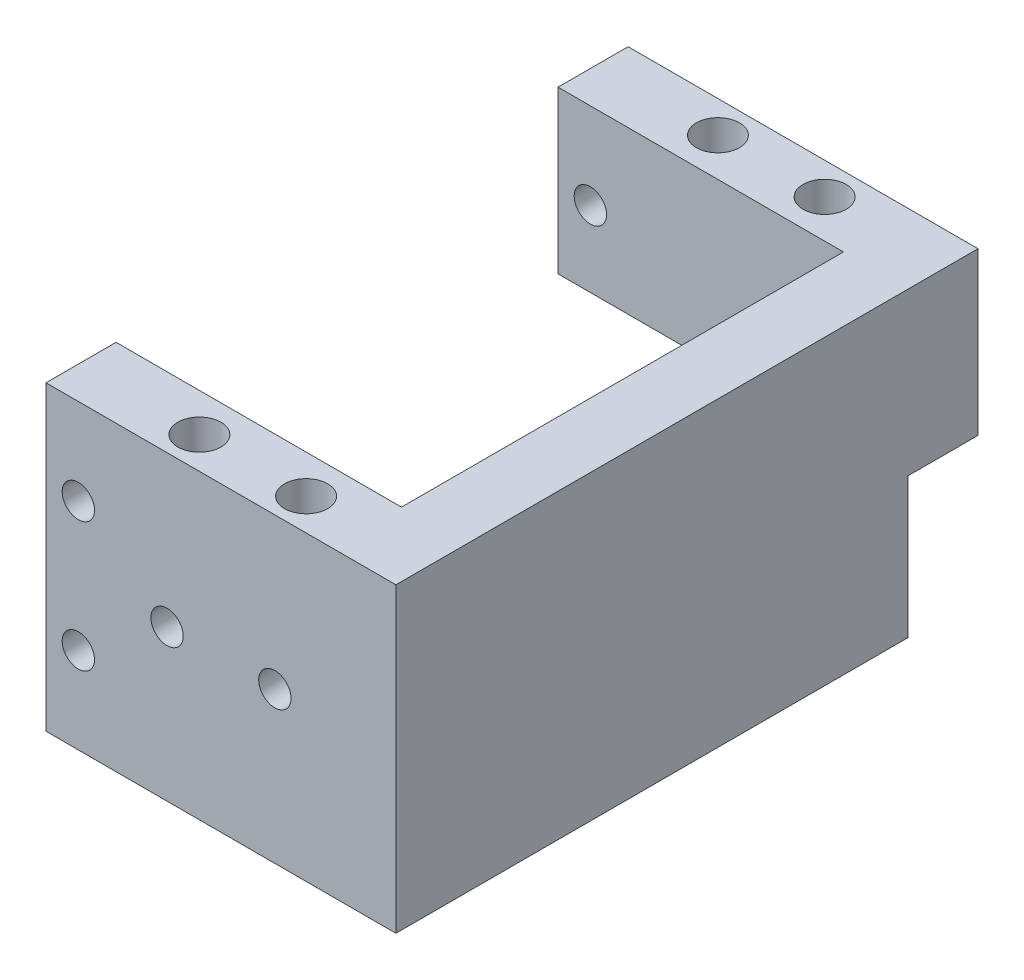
from build123d import *

# Parameters (mm, degrees)
SKETCH2_W           = 5.98
SKETCH2_H           = 20.5
SKETCH2_R           = 1.5
SKETCH2_R_2         = 2
BOSS_EXTRUDE1_DEPTH = 28
SKETCH2_4_R         = 1.5
CUT_EXTRUDE1_DEPTH  = 15
SKETCH3_W           = 6.5
SKETCH3_H           = 15
BOSS_EXTRUDE2_DEPTH = 32.46
SKETCH2_5_R         = 2
CUT_EXTRUDE2_DEPTH  = 94.46
SKETCH2_6_R         = 2
CUT_EXTRUDE4_DEPTH  = 8
CUT_EXTRUDE5_START  = -8
SKETCH5_R           = 2
CUT_EXTRUDE5_DEPTH  = 8
CUT_EXTRUDE3_DEPTH  = 10
CUT_EXTRUDE6_DEPTH  = 3.5
CUT_EXTRUDE7_REACH  = 54.466
SKETCH11_W          = 41
SKETCH11_H          = 28
SKETCH12_R          = 1.5
CUT_EXTRUDE8_DEPTH  = 64


with BuildPart() as part:
    # Sketch2 → Boss-Extrude1 (new body)
    # profile 1 of 12: a face of its own
    with BuildSketch(Plane(origin=(0, 0, 0), x_dir=(1, 0, 0), z_dir=(0, 1, 0))):
        with Locations((-13.24, -7)):
            Rectangle(SKETCH2_W, SKETCH2_H)
        with Locations((-13.23, -13.25)):
            Circle(SKETCH2_R, mode=Mode.SUBTRACT)
    # profile 2 of 12: a face of its own
    with BuildSketch(Plane(origin=(0, 0, 0), x_dir=(1, 0, 0), z_dir=(0, 1, 0))):
        with Locations((-13.23, -13.25)):
            Circle(SKETCH2_R)
    # profile 3 of 12: a face of its own
    with BuildSketch(Plane(origin=(0, 0, 0), x_dir=(1, 0, 0), z_dir=(0, 1, 0))):
        with Locations((-13.24, 13.5)):
            Rectangle(SKETCH2_W, SKETCH2_H)
        with Locations((-13.23, 19.75)):
            Circle(SKETCH2_R, mode=Mode.SUBTRACT)
    # profile 4 of 12: a face of its own
    with BuildSketch(Plane(origin=(0, 0, 0), x_dir=(1, 0, 0), z_dir=(0, 1, 0))):
        with Locations((-13.23, 19.75)):
            Circle(SKETCH2_R)
    # profile 5 of 12: a face of its own
    with BuildSketch(Plane(origin=(0, 0, 0), x_dir=(1, 0, 0), z_dir=(0, 1, 0))):
        with Locations((13.24, 13.5)):
            Rectangle(SKETCH2_W, SKETCH2_H)
        with Locations((13.23, 19.75)):
            Circle(SKETCH2_R, mode=Mode.SUBTRACT)
    # profile 6 of 12: a face of its own
    with BuildSketch(Plane(origin=(0, 0, 0), x_dir=(1, 0, 0), z_dir=(0, 1, 0))):
        with Locations((13.23, 19.75)):
            Circle(SKETCH2_R)
    # profile 7 of 12: a face of its own
    with BuildSketch(Plane(origin=(0, 0, 0), x_dir=(1, 0, 0), z_dir=(0, 1, 0))):
        with Locations((13.24, -7)):
            Rectangle(SKETCH2_W, SKETCH2_H)
        with Locations((13.23, -13.25)):
            Circle(SKETCH2_R, mode=Mode.SUBTRACT)
    # profile 8 of 12: a face of its own
    with BuildSketch(Plane(origin=(0, 0, 0), x_dir=(1, 0, 0), z_dir=(0, 1, 0))):
        with Locations((13.23, -13.25)):
            Circle(SKETCH2_R)
    # profile 9 of 12: a face of its own
    with BuildSketch(Plane(origin=(0, 0, 0), x_dir=(1, 0, 0), z_dir=(0, 1, 0))):
        Polygon((0, -23.75), (0, -17.25), (-10.25, -17.25), (-16.23, -17.25), (-16.23, -23.75), align=None)
        with Locations((-4.95, -20.8)):
            Circle(SKETCH2_R_2, mode=Mode.SUBTRACT)
    # profile 10 of 12: a face of its own
    with BuildSketch(Plane(origin=(0, 0, 0), x_dir=(1, 0, 0), z_dir=(0, 1, 0))):
        with Locations((-4.95, -20.8)):
            Circle(SKETCH2_R_2)
    # profile 11 of 12: a face of its own
    with BuildSketch(Plane(origin=(0, 0, 0), x_dir=(1, 0, 0), z_dir=(0, 1, 0))):
        Polygon((10.25, -17.25), (0, -17.25), (0, -23.75), (16.23, -23.75), (16.23, -17.25), align=None)
        with Locations((4.95, -20.8)):
            Circle(SKETCH2_R_2, mode=Mode.SUBTRACT)
    # profile 12 of 12: a face of its own
    with BuildSketch(Plane(origin=(0, 0, 0), x_dir=(1, 0, 0), z_dir=(0, 1, 0))):
        with Locations((4.95, -20.8)):
            Circle(SKETCH2_R_2)
    extrude(amount=BOSS_EXTRUDE1_DEPTH)

    # Sketch2_4 → Cut-Extrude1 (cut)
    with BuildSketch(Plane(origin=(0, 0, 0), x_dir=(1, 0, 0), z_dir=(0, 1, 0))):
        with Locations(Location((13.23, 19.75, 0), (0, 0, 270))):
            Circle(SKETCH2_4_R)
        with Locations(Location((-13.23, 19.75, 0), (0, 0, 270))):
            Circle(SKETCH2_4_R)
        with Locations(Location((-13.23, -13.25, 0), (0, 0, 270))):
            Circle(SKETCH2_4_R)
        with Locations(Location((13.23, -13.25, 0), (0, 0, 270))):
            Circle(SKETCH2_4_R)
    extrude(amount=CUT_EXTRUDE1_DEPTH, mode=Mode.SUBTRACT)

    # Sketch3 → Boss-Extrude2 (add)
    with BuildSketch(Plane.ZY.offset(16.23)):
        with Locations((-27, 20.5)):
            Rectangle(SKETCH3_W, SKETCH3_H)
    extrude(amount=-BOSS_EXTRUDE2_DEPTH)

    # Sketch2_5 → Cut-Extrude2 (cut)
    with BuildSketch(Plane(origin=(0, 0, 0), x_dir=(1, 0, 0), z_dir=(0, 1, 0))):
        with Locations(Location((-4.95, 27.3, 0), (0, 0, 90))):
            Circle(SKETCH2_5_R)
        with Locations(Location((4.95, 27.3, 0), (0, 0, 90))):
            Circle(SKETCH2_5_R)
    extrude(amount=CUT_EXTRUDE2_DEPTH, mode=Mode.SUBTRACT)

    # Sketch2_6 → Cut-Extrude4 (cut)
    with BuildSketch(Plane(origin=(0, 0, 0), x_dir=(1, 0, 0), z_dir=(0, 1, 0))):
        with Locations(Location((-4.95, -20.8, 0), (0, 0, 270))):
            Circle(SKETCH2_6_R)
        with Locations(Location((4.95, -20.8, 0), (0, 0, 270))):
            Circle(SKETCH2_6_R)
    extrude(amount=CUT_EXTRUDE4_DEPTH, mode=Mode.SUBTRACT)

    # Sketch5 → Cut-Extrude5 (cut)
    with BuildSketch(Plane(origin=(0, 28, 0), x_dir=(1, 0, 0), z_dir=(0, 1, 0)).offset(CUT_EXTRUDE5_START)):
        with Locations(Location((-4.95, -20.8, 0), (0, 0, 270))):
            Circle(SKETCH5_R)
        with Locations(Location((4.95, -20.8, 0), (0, 0, 270))):
            Circle(SKETCH5_R)
    extrude(amount=CUT_EXTRUDE5_DEPTH, mode=Mode.SUBTRACT)

    # Sketch4 → Cut-Extrude3 (cut)
    with BuildSketch(Plane(origin=(0, 0, 17.25), x_dir=(-1, 0, 0), z_dir=(0, 0, -1))):
        with BuildLine():
            ThreePointArc((-3.5, 14), (-5, 15.5), (-6.5, 14))
            Line((-6.5, 14), (-3.5, 14))
        make_face()
        with BuildLine():
            Line((-3.5, 14), (-6.5, 14))
            ThreePointArc((-6.5, 14), (-5, 12.5), (-3.5, 14))
        make_face()
        with BuildLine():
            ThreePointArc((-3.5, 14), (-5, 15.5), (-6.5, 14))
            Line((-6.5, 14), (-3.5, 14))
        make_face()
        with BuildLine():
            Line((-3.5, 14), (-6.5, 14))
            ThreePointArc((-6.5, 14), (-5, 12.5), (-3.5, 14))
        make_face()
        with BuildLine():
            ThreePointArc((6.5, 14), (5, 15.5), (3.5, 14))
            Line((3.5, 14), (6.5, 14))
        make_face()
        with BuildLine():
            Line((6.5, 14), (3.5, 14))
            ThreePointArc((3.5, 14), (5, 12.5), (6.5, 14))
        make_face()
        with BuildLine():
            ThreePointArc((6.5, 14), (5, 15.5), (3.5, 14))
            Line((3.5, 14), (6.5, 14))
        make_face()
        with BuildLine():
            Line((6.5, 14), (3.5, 14))
            ThreePointArc((3.5, 14), (5, 12.5), (6.5, 14))
        make_face()
    extrude(amount=-CUT_EXTRUDE3_DEPTH, mode=Mode.SUBTRACT)

    # Sketch4_3 → Cut-Extrude6 (cut)
    with BuildSketch(Plane(origin=(0, 0, 17.25), x_dir=(-1, 0, 0), z_dir=(0, 0, -1))):
        with BuildLine():
            ThreePointArc((-2, 14), (-5, 17), (-8, 14))
            Line((-8, 14), (-6.5, 14))
            ThreePointArc((-6.5, 14), (-5, 15.5), (-3.5, 14))
            Line((-3.5, 14), (-2, 14))
        make_face()
        with BuildLine():
            Line((-6.5, 14), (-8, 14))
            ThreePointArc((-8, 14), (-5, 11), (-2, 14))
            Line((-2, 14), (-3.5, 14))
            ThreePointArc((-3.5, 14), (-5, 12.5), (-6.5, 14))
        make_face()
        with BuildLine():
            ThreePointArc((-2, 14), (-5, 17), (-8, 14))
            Line((-8, 14), (-6.5, 14))
            ThreePointArc((-6.5, 14), (-5, 15.5), (-3.5, 14))
            Line((-3.5, 14), (-2, 14))
        make_face()
        with BuildLine():
            Line((-6.5, 14), (-8, 14))
            ThreePointArc((-8, 14), (-5, 11), (-2, 14))
            Line((-2, 14), (-3.5, 14))
            ThreePointArc((-3.5, 14), (-5, 12.5), (-6.5, 14))
        make_face()
        with BuildLine():
            ThreePointArc((8, 14), (5, 17), (2, 14))
            Line((2, 14), (3.5, 14))
            ThreePointArc((3.5, 14), (5, 15.5), (6.5, 14))
            Line((6.5, 14), (8, 14))
        make_face()
        with BuildLine():
            Line((3.5, 14), (2, 14))
            ThreePointArc((2, 14), (5, 11), (8, 14))
            Line((8, 14), (6.5, 14))
            ThreePointArc((6.5, 14), (5, 12.5), (3.5, 14))
        make_face()
        with BuildLine():
            ThreePointArc((8, 14), (5, 17), (2, 14))
            Line((2, 14), (3.5, 14))
            ThreePointArc((3.5, 14), (5, 15.5), (6.5, 14))
            Line((6.5, 14), (8, 14))
        make_face()
        with BuildLine():
            Line((3.5, 14), (2, 14))
            ThreePointArc((2, 14), (5, 11), (8, 14))
            Line((8, 14), (6.5, 14))
            ThreePointArc((6.5, 14), (5, 12.5), (3.5, 14))
        make_face()
    extrude(amount=-CUT_EXTRUDE6_DEPTH, mode=Mode.SUBTRACT)

    # Sketch11 → Cut-Extrude7 (cut, up to next)
    with BuildSketch(Plane.ZY.offset(16.23), mode=Mode.PRIVATE) as cut_extrude7_sk1:
        with Locations((-3.25, 14)):
            Rectangle(SKETCH11_W, SKETCH11_H)
    cut_extrude7_tool1 = extrude(cut_extrude7_sk1.sketch, amount=-CUT_EXTRUDE7_REACH, mode=Mode.PRIVATE) & part.part
    add(cut_extrude7_tool1.solids().sort_by_distance((-16.23, 14, -3.25))[0], mode=Mode.SUBTRACT)

    # Sketch12 → Cut-Extrude8 (cut)
    with BuildSketch(Plane(origin=(0, 0, -30.25), x_dir=(-1, 0, 0), z_dir=(0, 0, -1))):
        with Locations(Location((13.23, 20, 0), (0, 0, 90))):
            Circle(SKETCH12_R)
        with Locations((13.23, 8)):
            Circle(SKETCH12_R)
    extrude(amount=-CUT_EXTRUDE8_DEPTH, mode=Mode.SUBTRACT)


solid = part.part
